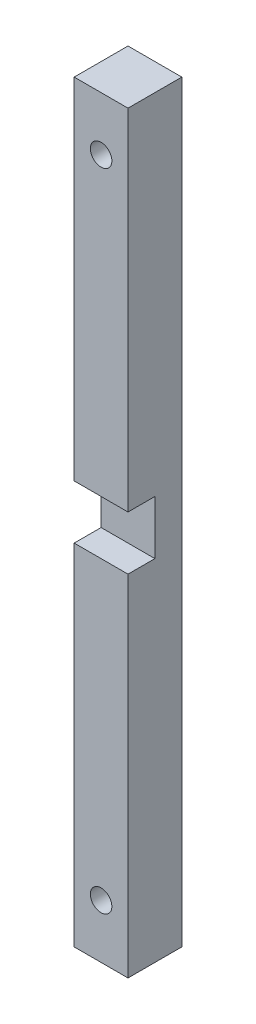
ISO-10303-21;
HEADER;
FILE_DESCRIPTION(('STEP AP214'),'2;1');
FILE_NAME('part.step','',(''),(''),'','','');
FILE_SCHEMA(('AUTOMOTIVE_DESIGN { 1 0 10303 214 1 1 1 1 }'));
ENDSEC;
DATA;
#1=APPLICATION_CONTEXT('core data for automotive mechanical design processes');
#2=APPLICATION_PROTOCOL_DEFINITION('international standard','automotive_design',2000,#1);
#3=PRODUCT_CONTEXT('',#1,'mechanical');
#4=PRODUCT('Part','Part','',(#3));
#5=PRODUCT_RELATED_PRODUCT_CATEGORY('part','',(#4));
#6=PRODUCT_DEFINITION_FORMATION('','',#4);
#7=PRODUCT_DEFINITION_CONTEXT('part definition',#1,'design');
#8=PRODUCT_DEFINITION('design','',#6,#7);
#9=PRODUCT_DEFINITION_SHAPE('','',#8);
#10=(LENGTH_UNIT() NAMED_UNIT(*) SI_UNIT(.MILLI.,.METRE.));
#11=(NAMED_UNIT(*) PLANE_ANGLE_UNIT() SI_UNIT($,.RADIAN.));
#12=(NAMED_UNIT(*) SI_UNIT($,.STERADIAN.) SOLID_ANGLE_UNIT());
#13=UNCERTAINTY_MEASURE_WITH_UNIT(LENGTH_MEASURE(1.E-05),#10,'distance_accuracy_value','');
#14=(GEOMETRIC_REPRESENTATION_CONTEXT(3) GLOBAL_UNCERTAINTY_ASSIGNED_CONTEXT((#13)) GLOBAL_UNIT_ASSIGNED_CONTEXT((#10,
#11,#12)) REPRESENTATION_CONTEXT('',''));
#15=CARTESIAN_POINT('',(0.,0.,0.));
#16=DIRECTION('',(0.,0.,1.));
#17=DIRECTION('',(1.,0.,0.));
#18=AXIS2_PLACEMENT_3D('',#15,#16,#17);
#19=CARTESIAN_POINT('',(0.,0.,10.));
#20=DIRECTION('',(0.,0.,1.));
#21=DIRECTION('',(1.,0.,0.));
#22=AXIS2_PLACEMENT_3D('',#19,#20,#21);
#23=PLANE('',#22);
#24=DIRECTION('',(1.,0.,0.));
#25=VECTOR('',#24,1.);
#26=CARTESIAN_POINT('',(10.,-75.,10.));
#27=LINE('',#26,#25);
#28=CARTESIAN_POINT('',(0.,-75.,10.));
#29=VERTEX_POINT('',#28);
#30=CARTESIAN_POINT('',(10.,-75.,10.));
#31=VERTEX_POINT('',#30);
#32=EDGE_CURVE('E118',#29,#31,#27,.T.);
#33=ORIENTED_EDGE('',*,*,#32,.F.);
#34=DIRECTION('',(0.,-1.,0.));
#35=VECTOR('',#34,1.);
#36=CARTESIAN_POINT('',(0.,0.,10.));
#37=LINE('',#36,#35);
#38=CARTESIAN_POINT('',(0.,-140.,10.));
#39=VERTEX_POINT('',#38);
#40=EDGE_CURVE('E91',#29,#39,#37,.T.);
#41=ORIENTED_EDGE('',*,*,#40,.T.);
#42=DIRECTION('',(1.,0.,0.));
#43=VECTOR('',#42,1.);
#44=CARTESIAN_POINT('',(0.,-140.,10.));
#45=LINE('',#44,#43);
#46=CARTESIAN_POINT('',(10.,-140.,10.));
#47=VERTEX_POINT('',#46);
#48=EDGE_CURVE('E158',#39,#47,#45,.T.);
#49=ORIENTED_EDGE('',*,*,#48,.T.);
#50=DIRECTION('',(0.,1.,0.));
#51=VECTOR('',#50,1.);
#52=CARTESIAN_POINT('',(10.,0.,10.));
#53=LINE('',#52,#51);
#54=EDGE_CURVE('E161',#47,#31,#53,.T.);
#55=ORIENTED_EDGE('',*,*,#54,.T.);
#56=EDGE_LOOP('',(#33,#41,#49,#55));
#57=FACE_BOUND('',#56,.T.);
#58=CARTESIAN_POINT('',(5.,-130.,10.));
#59=DIRECTION('',(0.,0.,1.));
#60=DIRECTION('',(1.,0.,0.));
#61=AXIS2_PLACEMENT_3D('',#58,#59,#60);
#62=CIRCLE('',#61,2.);
#63=CARTESIAN_POINT('',(7.,-130.,10.));
#64=VERTEX_POINT('',#63);
#65=EDGE_CURVE('E145',#64,#64,#62,.T.);
#66=ORIENTED_EDGE('',*,*,#65,.F.);
#67=EDGE_LOOP('',(#66));
#68=FACE_BOUND('',#67,.T.);
#69=ADVANCED_FACE('F36',(#57,#68),#23,.T.);
#70=CARTESIAN_POINT('',(0.,0.,10.));
#71=DIRECTION('',(1.,0.,0.));
#72=DIRECTION('',(0.,1.,0.));
#73=AXIS2_PLACEMENT_3D('',#70,#71,#72);
#74=PLANE('',#73);
#75=ORIENTED_EDGE('',*,*,#40,.F.);
#76=DIRECTION('',(0.,0.,1.));
#77=VECTOR('',#76,1.);
#78=CARTESIAN_POINT('',(0.,-75.,5.));
#79=LINE('',#78,#77);
#80=CARTESIAN_POINT('',(0.,-75.,5.));
#81=VERTEX_POINT('',#80);
#82=EDGE_CURVE('E143',#81,#29,#79,.T.);
#83=ORIENTED_EDGE('',*,*,#82,.F.);
#84=DIRECTION('',(0.,-1.,0.));
#85=VECTOR('',#84,1.);
#86=CARTESIAN_POINT('',(0.,-65.,5.));
#87=LINE('',#86,#85);
#88=CARTESIAN_POINT('',(0.,-65.,5.));
#89=VERTEX_POINT('',#88);
#90=EDGE_CURVE('E123',#89,#81,#87,.T.);
#91=ORIENTED_EDGE('',*,*,#90,.F.);
#92=DIRECTION('',(0.,0.,1.));
#93=VECTOR('',#92,1.);
#94=CARTESIAN_POINT('',(0.,-65.,5.));
#95=LINE('',#94,#93);
#96=CARTESIAN_POINT('',(0.,-65.,10.));
#97=VERTEX_POINT('',#96);
#98=EDGE_CURVE('E146',#89,#97,#95,.T.);
#99=ORIENTED_EDGE('',*,*,#98,.T.);
#100=CARTESIAN_POINT('',(0.,0.,10.));
#101=VERTEX_POINT('',#100);
#102=EDGE_CURVE('E156',#101,#97,#37,.T.);
#103=ORIENTED_EDGE('',*,*,#102,.F.);
#104=DIRECTION('',(0.,0.,-1.));
#105=VECTOR('',#104,1.);
#106=CARTESIAN_POINT('',(0.,0.,10.));
#107=LINE('',#106,#105);
#108=CARTESIAN_POINT('',(0.,0.,0.));
#109=VERTEX_POINT('',#108);
#110=EDGE_CURVE('E164',#101,#109,#107,.T.);
#111=ORIENTED_EDGE('',*,*,#110,.T.);
#112=DIRECTION('',(0.,-1.,0.));
#113=VECTOR('',#112,1.);
#114=CARTESIAN_POINT('',(0.,0.,0.));
#115=LINE('',#114,#113);
#116=CARTESIAN_POINT('',(0.,-140.,0.));
#117=VERTEX_POINT('',#116);
#118=EDGE_CURVE('E165',#109,#117,#115,.T.);
#119=ORIENTED_EDGE('',*,*,#118,.T.);
#120=DIRECTION('',(0.,0.,-1.));
#121=VECTOR('',#120,1.);
#122=CARTESIAN_POINT('',(0.,-140.,10.));
#123=LINE('',#122,#121);
#124=EDGE_CURVE('E11',#39,#117,#123,.T.);
#125=ORIENTED_EDGE('',*,*,#124,.F.);
#126=EDGE_LOOP('',(#75,#83,#91,#99,#103,#111,#119,#125));
#127=FACE_BOUND('',#126,.T.);
#128=ADVANCED_FACE('F38',(#127),#74,.F.);
#129=CARTESIAN_POINT('',(0.,-140.,10.));
#130=DIRECTION('',(0.,1.,0.));
#131=DIRECTION('',(0.,0.,1.));
#132=AXIS2_PLACEMENT_3D('',#129,#130,#131);
#133=PLANE('',#132);
#134=DIRECTION('',(1.,0.,0.));
#135=VECTOR('',#134,1.);
#136=CARTESIAN_POINT('',(0.,-140.,0.));
#137=LINE('',#136,#135);
#138=CARTESIAN_POINT('',(10.,-140.,0.));
#139=VERTEX_POINT('',#138);
#140=EDGE_CURVE('E168',#117,#139,#137,.T.);
#141=ORIENTED_EDGE('',*,*,#140,.T.);
#142=DIRECTION('',(0.,0.,-1.));
#143=VECTOR('',#142,1.);
#144=CARTESIAN_POINT('',(10.,-140.,10.));
#145=LINE('',#144,#143);
#146=EDGE_CURVE('E45',#47,#139,#145,.T.);
#147=ORIENTED_EDGE('',*,*,#146,.F.);
#148=ORIENTED_EDGE('',*,*,#48,.F.);
#149=ORIENTED_EDGE('',*,*,#124,.T.);
#150=EDGE_LOOP('',(#141,#147,#148,#149));
#151=FACE_BOUND('',#150,.T.);
#152=ADVANCED_FACE('F204',(#151),#133,.F.);
#153=CARTESIAN_POINT('',(10.,0.,10.));
#154=DIRECTION('',(-1.,0.,0.));
#155=DIRECTION('',(0.,-1.,0.));
#156=AXIS2_PLACEMENT_3D('',#153,#154,#155);
#157=PLANE('',#156);
#158=DIRECTION('',(0.,1.,0.));
#159=VECTOR('',#158,1.);
#160=CARTESIAN_POINT('',(10.,-65.,5.));
#161=LINE('',#160,#159);
#162=CARTESIAN_POINT('',(10.,-75.,5.));
#163=VERTEX_POINT('',#162);
#164=CARTESIAN_POINT('',(10.,-65.,5.));
#165=VERTEX_POINT('',#164);
#166=EDGE_CURVE('E129',#163,#165,#161,.T.);
#167=ORIENTED_EDGE('',*,*,#166,.F.);
#168=DIRECTION('',(0.,0.,1.));
#169=VECTOR('',#168,1.);
#170=CARTESIAN_POINT('',(10.,-75.,5.));
#171=LINE('',#170,#169);
#172=EDGE_CURVE('E113',#163,#31,#171,.T.);
#173=ORIENTED_EDGE('',*,*,#172,.T.);
#174=ORIENTED_EDGE('',*,*,#54,.F.);
#175=ORIENTED_EDGE('',*,*,#146,.T.);
#176=DIRECTION('',(0.,1.,0.));
#177=VECTOR('',#176,1.);
#178=CARTESIAN_POINT('',(10.,0.,0.));
#179=LINE('',#178,#177);
#180=CARTESIAN_POINT('',(10.,0.,0.));
#181=VERTEX_POINT('',#180);
#182=EDGE_CURVE('E170',#139,#181,#179,.T.);
#183=ORIENTED_EDGE('',*,*,#182,.T.);
#184=DIRECTION('',(0.,0.,-1.));
#185=VECTOR('',#184,1.);
#186=CARTESIAN_POINT('',(10.,0.,10.));
#187=LINE('',#186,#185);
#188=CARTESIAN_POINT('',(10.,0.,10.));
#189=VERTEX_POINT('',#188);
#190=EDGE_CURVE('E174',#189,#181,#187,.T.);
#191=ORIENTED_EDGE('',*,*,#190,.F.);
#192=CARTESIAN_POINT('',(10.,-65.,10.));
#193=VERTEX_POINT('',#192);
#194=EDGE_CURVE('E160',#193,#189,#53,.T.);
#195=ORIENTED_EDGE('',*,*,#194,.F.);
#196=DIRECTION('',(0.,0.,1.));
#197=VECTOR('',#196,1.);
#198=CARTESIAN_POINT('',(10.,-65.,5.));
#199=LINE('',#198,#197);
#200=EDGE_CURVE('E53',#165,#193,#199,.T.);
#201=ORIENTED_EDGE('',*,*,#200,.F.);
#202=EDGE_LOOP('',(#167,#173,#174,#175,#183,#191,#195,#201));
#203=FACE_BOUND('',#202,.T.);
#204=ADVANCED_FACE('F134',(#203),#157,.F.);
#205=CARTESIAN_POINT('',(0.,0.,10.));
#206=DIRECTION('',(0.,-1.,0.));
#207=DIRECTION('',(0.,0.,-1.));
#208=AXIS2_PLACEMENT_3D('',#205,#206,#207);
#209=PLANE('',#208);
#210=DIRECTION('',(-1.,0.,0.));
#211=VECTOR('',#210,1.);
#212=CARTESIAN_POINT('',(0.,0.,0.));
#213=LINE('',#212,#211);
#214=EDGE_CURVE('E83',#181,#109,#213,.T.);
#215=ORIENTED_EDGE('',*,*,#214,.T.);
#216=ORIENTED_EDGE('',*,*,#110,.F.);
#217=DIRECTION('',(-1.,0.,0.));
#218=VECTOR('',#217,1.);
#219=CARTESIAN_POINT('',(0.,0.,10.));
#220=LINE('',#219,#218);
#221=EDGE_CURVE('E62',#189,#101,#220,.T.);
#222=ORIENTED_EDGE('',*,*,#221,.F.);
#223=ORIENTED_EDGE('',*,*,#190,.T.);
#224=EDGE_LOOP('',(#215,#216,#222,#223));
#225=FACE_BOUND('',#224,.T.);
#226=ADVANCED_FACE('F209',(#225),#209,.F.);
#227=DIRECTION('',(-1.,0.,0.));
#228=VECTOR('',#227,1.);
#229=CARTESIAN_POINT('',(0.,-65.,10.));
#230=LINE('',#229,#228);
#231=EDGE_CURVE('E132',#193,#97,#230,.T.);
#232=ORIENTED_EDGE('',*,*,#231,.F.);
#233=ORIENTED_EDGE('',*,*,#194,.T.);
#234=ORIENTED_EDGE('',*,*,#221,.T.);
#235=ORIENTED_EDGE('',*,*,#102,.T.);
#236=EDGE_LOOP('',(#232,#233,#234,#235));
#237=FACE_BOUND('',#236,.T.);
#238=CARTESIAN_POINT('',(5.,-10.,10.));
#239=DIRECTION('',(0.,0.,1.));
#240=DIRECTION('',(1.,0.,0.));
#241=AXIS2_PLACEMENT_3D('',#238,#239,#240);
#242=CIRCLE('',#241,2.);
#243=CARTESIAN_POINT('',(7.,-10.,10.));
#244=VERTEX_POINT('',#243);
#245=EDGE_CURVE('E150',#244,#244,#242,.T.);
#246=ORIENTED_EDGE('',*,*,#245,.F.);
#247=EDGE_LOOP('',(#246));
#248=FACE_BOUND('',#247,.T.);
#249=ADVANCED_FACE('F200',(#237,#248),#23,.T.);
#250=CARTESIAN_POINT('',(0.,0.,0.));
#251=DIRECTION('',(0.,0.,1.));
#252=DIRECTION('',(1.,0.,0.));
#253=AXIS2_PLACEMENT_3D('',#250,#251,#252);
#254=PLANE('',#253);
#255=CARTESIAN_POINT('',(5.,-10.,0.));
#256=DIRECTION('',(0.,0.,1.));
#257=DIRECTION('',(1.,0.,0.));
#258=AXIS2_PLACEMENT_3D('',#255,#256,#257);
#259=CIRCLE('',#258,2.);
#260=CARTESIAN_POINT('',(7.,-10.,0.));
#261=VERTEX_POINT('',#260);
#262=EDGE_CURVE('E40',#261,#261,#259,.T.);
#263=ORIENTED_EDGE('',*,*,#262,.T.);
#264=EDGE_LOOP('',(#263));
#265=FACE_BOUND('',#264,.T.);
#266=CARTESIAN_POINT('',(5.,-130.,0.));
#267=DIRECTION('',(0.,0.,1.));
#268=DIRECTION('',(1.,0.,0.));
#269=AXIS2_PLACEMENT_3D('',#266,#267,#268);
#270=CIRCLE('',#269,2.);
#271=CARTESIAN_POINT('',(7.,-130.,0.));
#272=VERTEX_POINT('',#271);
#273=EDGE_CURVE('E153',#272,#272,#270,.T.);
#274=ORIENTED_EDGE('',*,*,#273,.T.);
#275=EDGE_LOOP('',(#274));
#276=FACE_BOUND('',#275,.T.);
#277=ORIENTED_EDGE('',*,*,#118,.F.);
#278=ORIENTED_EDGE('',*,*,#214,.F.);
#279=ORIENTED_EDGE('',*,*,#182,.F.);
#280=ORIENTED_EDGE('',*,*,#140,.F.);
#281=EDGE_LOOP('',(#277,#278,#279,#280));
#282=FACE_BOUND('',#281,.T.);
#283=ADVANCED_FACE('F183',(#265,#276,#282),#254,.F.);
#284=CARTESIAN_POINT('',(5.,-130.,-10.));
#285=DIRECTION('',(0.,0.,1.));
#286=DIRECTION('',(1.,0.,0.));
#287=AXIS2_PLACEMENT_3D('',#284,#285,#286);
#288=CYLINDRICAL_SURFACE('',#287,2.);
#289=ORIENTED_EDGE('',*,*,#65,.T.);
#290=EDGE_LOOP('',(#289));
#291=FACE_BOUND('',#290,.T.);
#292=ORIENTED_EDGE('',*,*,#273,.F.);
#293=EDGE_LOOP('',(#292));
#294=FACE_BOUND('',#293,.T.);
#295=ADVANCED_FACE('F187',(#291,#294),#288,.F.);
#296=CARTESIAN_POINT('',(5.,-10.,-10.));
#297=DIRECTION('',(0.,0.,1.));
#298=DIRECTION('',(1.,0.,0.));
#299=AXIS2_PLACEMENT_3D('',#296,#297,#298);
#300=CYLINDRICAL_SURFACE('',#299,2.);
#301=ORIENTED_EDGE('',*,*,#245,.T.);
#302=EDGE_LOOP('',(#301));
#303=FACE_BOUND('',#302,.T.);
#304=ORIENTED_EDGE('',*,*,#262,.F.);
#305=EDGE_LOOP('',(#304));
#306=FACE_BOUND('',#305,.T.);
#307=ADVANCED_FACE('F185',(#303,#306),#300,.F.);
#308=CARTESIAN_POINT('',(10.,-75.,5.));
#309=DIRECTION('',(0.,-1.,0.));
#310=DIRECTION('',(0.,0.,-1.));
#311=AXIS2_PLACEMENT_3D('',#308,#309,#310);
#312=PLANE('',#311);
#313=ORIENTED_EDGE('',*,*,#32,.T.);
#314=ORIENTED_EDGE('',*,*,#172,.F.);
#315=DIRECTION('',(1.,0.,0.));
#316=VECTOR('',#315,1.);
#317=CARTESIAN_POINT('',(10.,-75.,5.));
#318=LINE('',#317,#316);
#319=EDGE_CURVE('E116',#81,#163,#318,.T.);
#320=ORIENTED_EDGE('',*,*,#319,.F.);
#321=ORIENTED_EDGE('',*,*,#82,.T.);
#322=EDGE_LOOP('',(#313,#314,#320,#321));
#323=FACE_BOUND('',#322,.T.);
#324=ADVANCED_FACE('F115',(#323),#312,.F.);
#325=CARTESIAN_POINT('',(0.,-65.,5.));
#326=DIRECTION('',(0.,1.,0.));
#327=DIRECTION('',(0.,0.,1.));
#328=AXIS2_PLACEMENT_3D('',#325,#326,#327);
#329=PLANE('',#328);
#330=ORIENTED_EDGE('',*,*,#231,.T.);
#331=ORIENTED_EDGE('',*,*,#98,.F.);
#332=DIRECTION('',(-1.,0.,0.));
#333=VECTOR('',#332,1.);
#334=CARTESIAN_POINT('',(0.,-65.,5.));
#335=LINE('',#334,#333);
#336=EDGE_CURVE('E136',#165,#89,#335,.T.);
#337=ORIENTED_EDGE('',*,*,#336,.F.);
#338=ORIENTED_EDGE('',*,*,#200,.T.);
#339=EDGE_LOOP('',(#330,#331,#337,#338));
#340=FACE_BOUND('',#339,.T.);
#341=ADVANCED_FACE('F194',(#340),#329,.F.);
#342=CARTESIAN_POINT('',(0.,0.,5.));
#343=DIRECTION('',(0.,0.,1.));
#344=DIRECTION('',(1.,0.,0.));
#345=AXIS2_PLACEMENT_3D('',#342,#343,#344);
#346=PLANE('',#345);
#347=ORIENTED_EDGE('',*,*,#319,.T.);
#348=ORIENTED_EDGE('',*,*,#166,.T.);
#349=ORIENTED_EDGE('',*,*,#336,.T.);
#350=ORIENTED_EDGE('',*,*,#90,.T.);
#351=EDGE_LOOP('',(#347,#348,#349,#350));
#352=FACE_BOUND('',#351,.T.);
#353=ADVANCED_FACE('F127',(#352),#346,.T.);
#354=CLOSED_SHELL('',(#69,#128,#152,#204,#226,#249,#283,#295,#307,#324,#341,#353));
#355=MANIFOLD_SOLID_BREP('B2',#354);
#356=ADVANCED_BREP_SHAPE_REPRESENTATION('',(#18,#355),#14);
#357=SHAPE_DEFINITION_REPRESENTATION(#9,#356);
ENDSEC;
END-ISO-10303-21;
